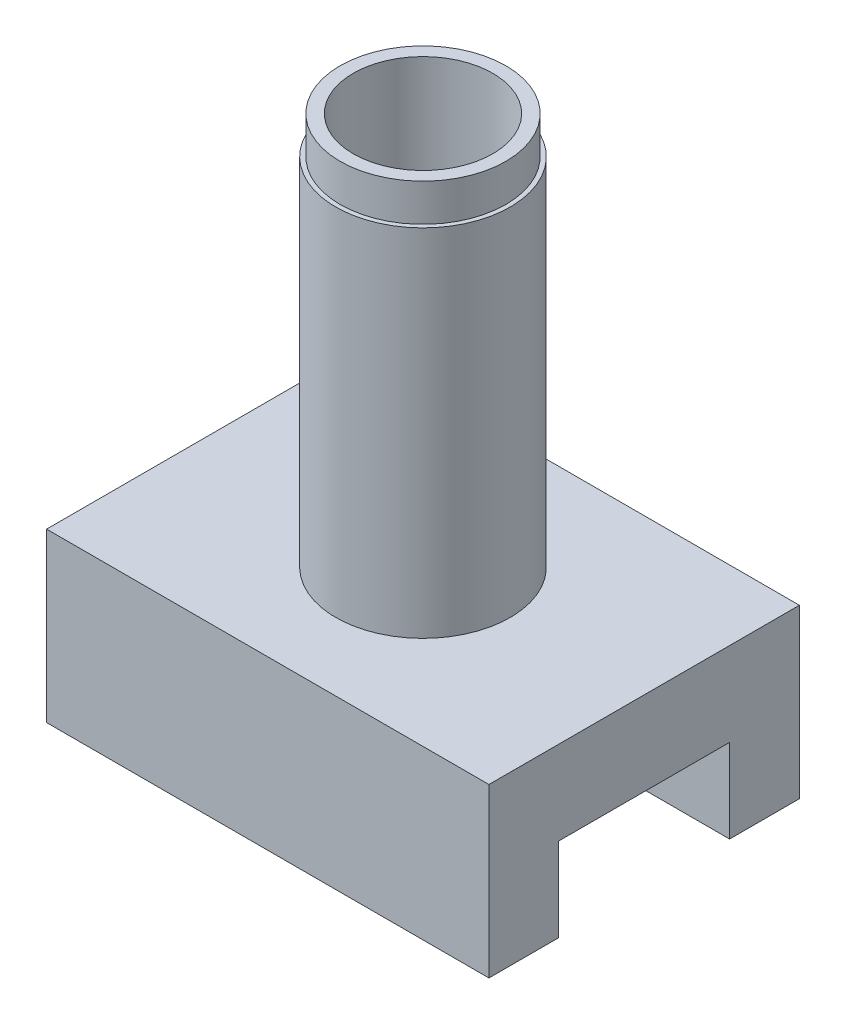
ISO-10303-21;
HEADER;
FILE_DESCRIPTION(('STEP AP214'),'2;1');
FILE_NAME('part.step','',(''),(''),'','','');
FILE_SCHEMA(('AUTOMOTIVE_DESIGN { 1 0 10303 214 1 1 1 1 }'));
ENDSEC;
DATA;
#1=APPLICATION_CONTEXT('core data for automotive mechanical design processes');
#2=APPLICATION_PROTOCOL_DEFINITION('international standard','automotive_design',2000,#1);
#3=PRODUCT_CONTEXT('',#1,'mechanical');
#4=PRODUCT('Part','Part','',(#3));
#5=PRODUCT_RELATED_PRODUCT_CATEGORY('part','',(#4));
#6=PRODUCT_DEFINITION_FORMATION('','',#4);
#7=PRODUCT_DEFINITION_CONTEXT('part definition',#1,'design');
#8=PRODUCT_DEFINITION('design','',#6,#7);
#9=PRODUCT_DEFINITION_SHAPE('','',#8);
#10=(LENGTH_UNIT() NAMED_UNIT(*) SI_UNIT(.MILLI.,.METRE.));
#11=(NAMED_UNIT(*) PLANE_ANGLE_UNIT() SI_UNIT($,.RADIAN.));
#12=(NAMED_UNIT(*) SI_UNIT($,.STERADIAN.) SOLID_ANGLE_UNIT());
#13=UNCERTAINTY_MEASURE_WITH_UNIT(LENGTH_MEASURE(1.E-05),#10,'distance_accuracy_value','');
#14=(GEOMETRIC_REPRESENTATION_CONTEXT(3) GLOBAL_UNCERTAINTY_ASSIGNED_CONTEXT((#13)) GLOBAL_UNIT_ASSIGNED_CONTEXT((#10,
#11,#12)) REPRESENTATION_CONTEXT('',''));
#15=CARTESIAN_POINT('',(0.,0.,0.));
#16=DIRECTION('',(0.,0.,1.));
#17=DIRECTION('',(1.,0.,0.));
#18=AXIS2_PLACEMENT_3D('',#15,#16,#17);
#19=CARTESIAN_POINT('',(0.,173.521,0.));
#20=DIRECTION('',(0.,-1.,0.));
#21=DIRECTION('',(0.,0.,-1.));
#22=AXIS2_PLACEMENT_3D('',#19,#20,#21);
#23=CYLINDRICAL_SURFACE('',#22,11.1125);
#24=CARTESIAN_POINT('',(0.,0.,0.));
#25=DIRECTION('',(0.,1.,0.));
#26=DIRECTION('',(0.,0.,1.));
#27=AXIS2_PLACEMENT_3D('',#24,#25,#26);
#28=CIRCLE('',#27,11.1125);
#29=CARTESIAN_POINT('',(0.,0.,11.1125));
#30=VERTEX_POINT('',#29);
#31=EDGE_CURVE('E210',#30,#30,#28,.T.);
#32=ORIENTED_EDGE('',*,*,#31,.F.);
#33=EDGE_LOOP('',(#32));
#34=FACE_BOUND('',#33,.T.);
#35=CARTESIAN_POINT('',(0.,16.804,0.));
#36=DIRECTION('',(0.,1.,0.));
#37=DIRECTION('',(0.,0.,1.));
#38=AXIS2_PLACEMENT_3D('',#35,#36,#37);
#39=CIRCLE('',#38,11.1125);
#40=CARTESIAN_POINT('',(0.,16.804,11.1125));
#41=VERTEX_POINT('',#40);
#42=EDGE_CURVE('E48',#41,#41,#39,.T.);
#43=ORIENTED_EDGE('',*,*,#42,.T.);
#44=EDGE_LOOP('',(#43));
#45=FACE_BOUND('',#44,.T.);
#46=ADVANCED_FACE('F44',(#34,#45),#23,.F.);
#47=CARTESIAN_POINT('',(80.5,-30.48,31.1));
#48=DIRECTION('',(0.,0.,1.));
#49=DIRECTION('',(0.,-1.,0.));
#50=AXIS2_PLACEMENT_3D('',#47,#48,#49);
#51=PLANE('',#50);
#52=DIRECTION('',(0.,1.,0.));
#53=VECTOR('',#52,1.);
#54=CARTESIAN_POINT('',(-80.5,-30.48,31.1));
#55=LINE('',#54,#53);
#56=CARTESIAN_POINT('',(-80.5,-30.48,31.1));
#57=VERTEX_POINT('',#56);
#58=CARTESIAN_POINT('',(-80.5,0.,31.1));
#59=VERTEX_POINT('',#58);
#60=EDGE_CURVE('E143',#57,#59,#55,.T.);
#61=ORIENTED_EDGE('',*,*,#60,.T.);
#62=DIRECTION('',(-1.,0.,0.));
#63=VECTOR('',#62,1.);
#64=CARTESIAN_POINT('',(80.5,0.,31.1));
#65=LINE('',#64,#63);
#66=CARTESIAN_POINT('',(80.5,0.,31.1));
#67=VERTEX_POINT('',#66);
#68=EDGE_CURVE('E54',#67,#59,#65,.T.);
#69=ORIENTED_EDGE('',*,*,#68,.F.);
#70=DIRECTION('',(0.,1.,0.));
#71=VECTOR('',#70,1.);
#72=CARTESIAN_POINT('',(80.5,-30.48,31.1));
#73=LINE('',#72,#71);
#74=CARTESIAN_POINT('',(80.5,-30.48,31.1));
#75=VERTEX_POINT('',#74);
#76=EDGE_CURVE('E158',#75,#67,#73,.T.);
#77=ORIENTED_EDGE('',*,*,#76,.F.);
#78=DIRECTION('',(-1.,0.,0.));
#79=VECTOR('',#78,1.);
#80=CARTESIAN_POINT('',(80.5,-30.48,31.1));
#81=LINE('',#80,#79);
#82=EDGE_CURVE('E139',#75,#57,#81,.T.);
#83=ORIENTED_EDGE('',*,*,#82,.T.);
#84=EDGE_LOOP('',(#61,#69,#77,#83));
#85=FACE_BOUND('',#84,.T.);
#86=ADVANCED_FACE('F46',(#85),#51,.F.);
#87=CARTESIAN_POINT('',(80.5,0.,31.1));
#88=DIRECTION('',(0.,1.,0.));
#89=DIRECTION('',(0.,0.,1.));
#90=AXIS2_PLACEMENT_3D('',#87,#88,#89);
#91=PLANE('',#90);
#92=ORIENTED_EDGE('',*,*,#31,.T.);
#93=EDGE_LOOP('',(#92));
#94=FACE_BOUND('',#93,.T.);
#95=DIRECTION('',(0.,0.,-1.));
#96=VECTOR('',#95,1.);
#97=CARTESIAN_POINT('',(-80.5,0.,31.1));
#98=LINE('',#97,#96);
#99=CARTESIAN_POINT('',(-80.5,0.,-31.1));
#100=VERTEX_POINT('',#99);
#101=EDGE_CURVE('E146',#59,#100,#98,.T.);
#102=ORIENTED_EDGE('',*,*,#101,.T.);
#103=DIRECTION('',(-1.,0.,0.));
#104=VECTOR('',#103,1.);
#105=CARTESIAN_POINT('',(80.5,0.,-31.1));
#106=LINE('',#105,#104);
#107=CARTESIAN_POINT('',(80.5,0.,-31.1));
#108=VERTEX_POINT('',#107);
#109=EDGE_CURVE('E168',#108,#100,#106,.T.);
#110=ORIENTED_EDGE('',*,*,#109,.F.);
#111=DIRECTION('',(0.,0.,-1.));
#112=VECTOR('',#111,1.);
#113=CARTESIAN_POINT('',(80.5,0.,31.1));
#114=LINE('',#113,#112);
#115=EDGE_CURVE('E106',#67,#108,#114,.T.);
#116=ORIENTED_EDGE('',*,*,#115,.F.);
#117=ORIENTED_EDGE('',*,*,#68,.T.);
#118=EDGE_LOOP('',(#102,#110,#116,#117));
#119=FACE_BOUND('',#118,.T.);
#120=ADVANCED_FACE('F172',(#94,#119),#91,.F.);
#121=CARTESIAN_POINT('',(80.5,0.,-31.1));
#122=DIRECTION('',(0.,0.,-1.));
#123=DIRECTION('',(0.,1.,0.));
#124=AXIS2_PLACEMENT_3D('',#121,#122,#123);
#125=PLANE('',#124);
#126=DIRECTION('',(0.,-1.,0.));
#127=VECTOR('',#126,1.);
#128=CARTESIAN_POINT('',(-80.5,0.,-31.1));
#129=LINE('',#128,#127);
#130=CARTESIAN_POINT('',(-80.5,-30.48,-31.1));
#131=VERTEX_POINT('',#130);
#132=EDGE_CURVE('E149',#100,#131,#129,.T.);
#133=ORIENTED_EDGE('',*,*,#132,.T.);
#134=DIRECTION('',(-1.,0.,0.));
#135=VECTOR('',#134,1.);
#136=CARTESIAN_POINT('',(80.5,-30.48,-31.1));
#137=LINE('',#136,#135);
#138=CARTESIAN_POINT('',(80.5,-30.48,-31.1));
#139=VERTEX_POINT('',#138);
#140=EDGE_CURVE('E165',#139,#131,#137,.T.);
#141=ORIENTED_EDGE('',*,*,#140,.F.);
#142=DIRECTION('',(0.,-1.,0.));
#143=VECTOR('',#142,1.);
#144=CARTESIAN_POINT('',(80.5,0.,-31.1));
#145=LINE('',#144,#143);
#146=EDGE_CURVE('E190',#108,#139,#145,.T.);
#147=ORIENTED_EDGE('',*,*,#146,.F.);
#148=ORIENTED_EDGE('',*,*,#109,.T.);
#149=EDGE_LOOP('',(#133,#141,#147,#148));
#150=FACE_BOUND('',#149,.T.);
#151=ADVANCED_FACE('F183',(#150),#125,.F.);
#152=CARTESIAN_POINT('',(80.5,-30.48,-31.1));
#153=DIRECTION('',(0.,1.,0.));
#154=DIRECTION('',(0.,0.,1.));
#155=AXIS2_PLACEMENT_3D('',#152,#153,#154);
#156=PLANE('',#155);
#157=DIRECTION('',(0.,0.,-1.));
#158=VECTOR('',#157,1.);
#159=CARTESIAN_POINT('',(-80.5,-30.48,-31.1));
#160=LINE('',#159,#158);
#161=CARTESIAN_POINT('',(-80.5,-30.48,-56.5));
#162=VERTEX_POINT('',#161);
#163=EDGE_CURVE('E151',#131,#162,#160,.T.);
#164=ORIENTED_EDGE('',*,*,#163,.T.);
#165=DIRECTION('',(-1.,0.,0.));
#166=VECTOR('',#165,1.);
#167=CARTESIAN_POINT('',(80.5,-30.48,-56.5));
#168=LINE('',#167,#166);
#169=CARTESIAN_POINT('',(80.5,-30.48,-56.5));
#170=VERTEX_POINT('',#169);
#171=EDGE_CURVE('E162',#170,#162,#168,.T.);
#172=ORIENTED_EDGE('',*,*,#171,.F.);
#173=DIRECTION('',(0.,0.,-1.));
#174=VECTOR('',#173,1.);
#175=CARTESIAN_POINT('',(80.5,-30.48,-31.1));
#176=LINE('',#175,#174);
#177=EDGE_CURVE('E189',#139,#170,#176,.T.);
#178=ORIENTED_EDGE('',*,*,#177,.F.);
#179=ORIENTED_EDGE('',*,*,#140,.T.);
#180=EDGE_LOOP('',(#164,#172,#178,#179));
#181=FACE_BOUND('',#180,.T.);
#182=ADVANCED_FACE('F187',(#181),#156,.F.);
#183=CARTESIAN_POINT('',(80.5,-30.48,-56.5));
#184=DIRECTION('',(0.,0.,1.));
#185=DIRECTION('',(0.,-1.,0.));
#186=AXIS2_PLACEMENT_3D('',#183,#184,#185);
#187=PLANE('',#186);
#188=DIRECTION('',(0.,1.,0.));
#189=VECTOR('',#188,1.);
#190=CARTESIAN_POINT('',(-80.5,-30.48,-56.5));
#191=LINE('',#190,#189);
#192=CARTESIAN_POINT('',(-80.5,30.52,-56.5));
#193=VERTEX_POINT('',#192);
#194=EDGE_CURVE('E153',#162,#193,#191,.T.);
#195=ORIENTED_EDGE('',*,*,#194,.T.);
#196=DIRECTION('',(-1.,0.,0.));
#197=VECTOR('',#196,1.);
#198=CARTESIAN_POINT('',(80.5,30.52,-56.5));
#199=LINE('',#198,#197);
#200=CARTESIAN_POINT('',(80.5,30.52,-56.5));
#201=VERTEX_POINT('',#200);
#202=EDGE_CURVE('E134',#201,#193,#199,.T.);
#203=ORIENTED_EDGE('',*,*,#202,.F.);
#204=DIRECTION('',(0.,1.,0.));
#205=VECTOR('',#204,1.);
#206=CARTESIAN_POINT('',(80.5,-30.48,-56.5));
#207=LINE('',#206,#205);
#208=EDGE_CURVE('E125',#170,#201,#207,.T.);
#209=ORIENTED_EDGE('',*,*,#208,.F.);
#210=ORIENTED_EDGE('',*,*,#171,.T.);
#211=EDGE_LOOP('',(#195,#203,#209,#210));
#212=FACE_BOUND('',#211,.T.);
#213=ADVANCED_FACE('F273',(#212),#187,.F.);
#214=CARTESIAN_POINT('',(80.5,30.52,-56.5));
#215=DIRECTION('',(0.,-1.,0.));
#216=DIRECTION('',(0.,0.,-1.));
#217=AXIS2_PLACEMENT_3D('',#214,#215,#216);
#218=PLANE('',#217);
#219=CARTESIAN_POINT('',(0.,30.52,0.));
#220=DIRECTION('',(0.,-1.,0.));
#221=DIRECTION('',(0.,0.,-1.));
#222=AXIS2_PLACEMENT_3D('',#219,#220,#221);
#223=CIRCLE('',#222,31.75);
#224=CARTESIAN_POINT('',(0.,30.52,-31.75));
#225=VERTEX_POINT('',#224);
#226=EDGE_CURVE('E13',#225,#225,#223,.F.);
#227=ORIENTED_EDGE('',*,*,#226,.F.);
#228=EDGE_LOOP('',(#227));
#229=FACE_BOUND('',#228,.T.);
#230=DIRECTION('',(0.,0.,1.));
#231=VECTOR('',#230,1.);
#232=CARTESIAN_POINT('',(-80.5,30.52,-56.5));
#233=LINE('',#232,#231);
#234=CARTESIAN_POINT('',(-80.5,30.52,56.5));
#235=VERTEX_POINT('',#234);
#236=EDGE_CURVE('E133',#193,#235,#233,.T.);
#237=ORIENTED_EDGE('',*,*,#236,.T.);
#238=DIRECTION('',(-1.,0.,0.));
#239=VECTOR('',#238,1.);
#240=CARTESIAN_POINT('',(80.5,30.52,56.5));
#241=LINE('',#240,#239);
#242=CARTESIAN_POINT('',(80.5,30.52,56.5));
#243=VERTEX_POINT('',#242);
#244=EDGE_CURVE('E130',#243,#235,#241,.T.);
#245=ORIENTED_EDGE('',*,*,#244,.F.);
#246=DIRECTION('',(0.,0.,1.));
#247=VECTOR('',#246,1.);
#248=CARTESIAN_POINT('',(80.5,30.52,-56.5));
#249=LINE('',#248,#247);
#250=EDGE_CURVE('E119',#201,#243,#249,.T.);
#251=ORIENTED_EDGE('',*,*,#250,.F.);
#252=ORIENTED_EDGE('',*,*,#202,.T.);
#253=EDGE_LOOP('',(#237,#245,#251,#252));
#254=FACE_BOUND('',#253,.T.);
#255=ADVANCED_FACE('F131',(#229,#254),#218,.F.);
#256=CARTESIAN_POINT('',(80.5,30.52,56.5));
#257=DIRECTION('',(0.,0.,-1.));
#258=DIRECTION('',(0.,1.,0.));
#259=AXIS2_PLACEMENT_3D('',#256,#257,#258);
#260=PLANE('',#259);
#261=DIRECTION('',(0.,-1.,0.));
#262=VECTOR('',#261,1.);
#263=CARTESIAN_POINT('',(-80.5,30.52,56.5));
#264=LINE('',#263,#262);
#265=CARTESIAN_POINT('',(-80.5,-30.48,56.5));
#266=VERTEX_POINT('',#265);
#267=EDGE_CURVE('E91',#235,#266,#264,.T.);
#268=ORIENTED_EDGE('',*,*,#267,.T.);
#269=DIRECTION('',(-1.,0.,0.));
#270=VECTOR('',#269,1.);
#271=CARTESIAN_POINT('',(80.5,-30.48,56.5));
#272=LINE('',#271,#270);
#273=CARTESIAN_POINT('',(80.5,-30.48,56.5));
#274=VERTEX_POINT('',#273);
#275=EDGE_CURVE('E135',#274,#266,#272,.T.);
#276=ORIENTED_EDGE('',*,*,#275,.F.);
#277=DIRECTION('',(0.,-1.,0.));
#278=VECTOR('',#277,1.);
#279=CARTESIAN_POINT('',(80.5,30.52,56.5));
#280=LINE('',#279,#278);
#281=EDGE_CURVE('E123',#243,#274,#280,.T.);
#282=ORIENTED_EDGE('',*,*,#281,.F.);
#283=ORIENTED_EDGE('',*,*,#244,.T.);
#284=EDGE_LOOP('',(#268,#276,#282,#283));
#285=FACE_BOUND('',#284,.T.);
#286=ADVANCED_FACE('F137',(#285),#260,.F.);
#287=CARTESIAN_POINT('',(80.5,-30.48,56.5));
#288=DIRECTION('',(0.,1.,0.));
#289=DIRECTION('',(0.,0.,1.));
#290=AXIS2_PLACEMENT_3D('',#287,#288,#289);
#291=PLANE('',#290);
#292=DIRECTION('',(0.,0.,-1.));
#293=VECTOR('',#292,1.);
#294=CARTESIAN_POINT('',(-80.5,-30.48,56.5));
#295=LINE('',#294,#293);
#296=EDGE_CURVE('E97',#266,#57,#295,.T.);
#297=ORIENTED_EDGE('',*,*,#296,.T.);
#298=ORIENTED_EDGE('',*,*,#82,.F.);
#299=DIRECTION('',(0.,0.,-1.));
#300=VECTOR('',#299,1.);
#301=CARTESIAN_POINT('',(80.5,-30.48,56.5));
#302=LINE('',#301,#300);
#303=EDGE_CURVE('E62',#274,#75,#302,.T.);
#304=ORIENTED_EDGE('',*,*,#303,.F.);
#305=ORIENTED_EDGE('',*,*,#275,.T.);
#306=EDGE_LOOP('',(#297,#298,#304,#305));
#307=FACE_BOUND('',#306,.T.);
#308=ADVANCED_FACE('F264',(#307),#291,.F.);
#309=CARTESIAN_POINT('',(80.5,0.,0.));
#310=DIRECTION('',(-1.,0.,0.));
#311=DIRECTION('',(0.,0.,1.));
#312=AXIS2_PLACEMENT_3D('',#309,#310,#311);
#313=PLANE('',#312);
#314=ORIENTED_EDGE('',*,*,#76,.T.);
#315=ORIENTED_EDGE('',*,*,#115,.T.);
#316=ORIENTED_EDGE('',*,*,#146,.T.);
#317=ORIENTED_EDGE('',*,*,#177,.T.);
#318=ORIENTED_EDGE('',*,*,#208,.T.);
#319=ORIENTED_EDGE('',*,*,#250,.T.);
#320=ORIENTED_EDGE('',*,*,#281,.T.);
#321=ORIENTED_EDGE('',*,*,#303,.T.);
#322=EDGE_LOOP('',(#314,#315,#316,#317,#318,#319,#320,#321));
#323=FACE_BOUND('',#322,.T.);
#324=ADVANCED_FACE('F121',(#323),#313,.F.);
#325=CARTESIAN_POINT('',(-80.5,0.,0.));
#326=DIRECTION('',(-1.,0.,0.));
#327=DIRECTION('',(0.,0.,1.));
#328=AXIS2_PLACEMENT_3D('',#325,#326,#327);
#329=PLANE('',#328);
#330=ORIENTED_EDGE('',*,*,#60,.F.);
#331=ORIENTED_EDGE('',*,*,#296,.F.);
#332=ORIENTED_EDGE('',*,*,#267,.F.);
#333=ORIENTED_EDGE('',*,*,#236,.F.);
#334=ORIENTED_EDGE('',*,*,#194,.F.);
#335=ORIENTED_EDGE('',*,*,#163,.F.);
#336=ORIENTED_EDGE('',*,*,#132,.F.);
#337=ORIENTED_EDGE('',*,*,#101,.F.);
#338=EDGE_LOOP('',(#330,#331,#332,#333,#334,#335,#336,#337));
#339=FACE_BOUND('',#338,.T.);
#340=ADVANCED_FACE('F177',(#339),#329,.T.);
#341=CARTESIAN_POINT('',(0.,173.52,0.));
#342=DIRECTION('',(0.,-1.,0.));
#343=DIRECTION('',(0.,0.,-1.));
#344=AXIS2_PLACEMENT_3D('',#341,#342,#343);
#345=CYLINDRICAL_SURFACE('',#344,31.75);
#346=CARTESIAN_POINT('',(0.,159.92,0.));
#347=DIRECTION('',(0.,-1.,0.));
#348=DIRECTION('',(0.,0.,-1.));
#349=AXIS2_PLACEMENT_3D('',#346,#347,#348);
#350=CIRCLE('',#349,31.75);
#351=CARTESIAN_POINT('',(0.,159.92,-31.75));
#352=VERTEX_POINT('',#351);
#353=EDGE_CURVE('E199',#352,#352,#350,.T.);
#354=ORIENTED_EDGE('',*,*,#353,.T.);
#355=EDGE_LOOP('',(#354));
#356=FACE_BOUND('',#355,.T.);
#357=ORIENTED_EDGE('',*,*,#226,.T.);
#358=EDGE_LOOP('',(#357));
#359=FACE_BOUND('',#358,.T.);
#360=ADVANCED_FACE('F250',(#356,#359),#345,.T.);
#361=CARTESIAN_POINT('',(31.75,159.92,0.));
#362=DIRECTION('',(0.,-1.,0.));
#363=DIRECTION('',(0.,0.,-1.));
#364=AXIS2_PLACEMENT_3D('',#361,#362,#363);
#365=PLANE('',#364);
#366=ORIENTED_EDGE('',*,*,#353,.F.);
#367=EDGE_LOOP('',(#366));
#368=FACE_BOUND('',#367,.T.);
#369=CARTESIAN_POINT('',(0.,159.92,0.));
#370=DIRECTION('',(0.,-1.,0.));
#371=DIRECTION('',(0.,0.,-1.));
#372=AXIS2_PLACEMENT_3D('',#369,#370,#371);
#373=CIRCLE('',#372,30.1625);
#374=CARTESIAN_POINT('',(0.,159.92,-30.1625));
#375=VERTEX_POINT('',#374);
#376=EDGE_CURVE('E204',#375,#375,#373,.T.);
#377=ORIENTED_EDGE('',*,*,#376,.T.);
#378=EDGE_LOOP('',(#377));
#379=FACE_BOUND('',#378,.T.);
#380=ADVANCED_FACE('F246',(#368,#379),#365,.F.);
#381=CARTESIAN_POINT('',(0.,0.,0.));
#382=DIRECTION('',(0.,-1.,0.));
#383=DIRECTION('',(0.,0.,-1.));
#384=AXIS2_PLACEMENT_3D('',#381,#382,#383);
#385=CYLINDRICAL_SURFACE('',#384,30.1625);
#386=ORIENTED_EDGE('',*,*,#376,.F.);
#387=EDGE_LOOP('',(#386));
#388=FACE_BOUND('',#387,.T.);
#389=CARTESIAN_POINT('',(0.,173.52,0.));
#390=DIRECTION('',(0.,-1.,0.));
#391=DIRECTION('',(0.,0.,-1.));
#392=AXIS2_PLACEMENT_3D('',#389,#390,#391);
#393=CIRCLE('',#392,30.1625);
#394=CARTESIAN_POINT('',(0.,173.52,-30.1625));
#395=VERTEX_POINT('',#394);
#396=EDGE_CURVE('E207',#395,#395,#393,.T.);
#397=ORIENTED_EDGE('',*,*,#396,.T.);
#398=EDGE_LOOP('',(#397));
#399=FACE_BOUND('',#398,.T.);
#400=ADVANCED_FACE('F242',(#388,#399),#385,.T.);
#401=CARTESIAN_POINT('',(0.,30.52,0.));
#402=DIRECTION('',(0.,1.,0.));
#403=DIRECTION('',(0.,0.,1.));
#404=AXIS2_PLACEMENT_3D('',#401,#402,#403);
#405=CIRCLE('',#404,19.05);
#406=CARTESIAN_POINT('',(0.,30.52,19.05));
#407=VERTEX_POINT('',#406);
#408=EDGE_CURVE('E213',#407,#407,#405,.T.);
#409=ORIENTED_EDGE('',*,*,#408,.F.);
#410=EDGE_LOOP('',(#409));
#411=FACE_BOUND('',#410,.T.);
#412=CARTESIAN_POINT('',(0.,30.52,0.));
#413=DIRECTION('',(0.,1.,0.));
#414=DIRECTION('',(0.,0.,1.));
#415=AXIS2_PLACEMENT_3D('',#412,#413,#414);
#416=CIRCLE('',#415,25.4);
#417=CARTESIAN_POINT('',(0.,30.52,25.4));
#418=VERTEX_POINT('',#417);
#419=EDGE_CURVE('E196',#418,#418,#416,.T.);
#420=ORIENTED_EDGE('',*,*,#419,.T.);
#421=EDGE_LOOP('',(#420));
#422=FACE_BOUND('',#421,.T.);
#423=ADVANCED_FACE('F245',(#411,#422),#218,.F.);
#424=CARTESIAN_POINT('',(0.,173.52,0.));
#425=DIRECTION('',(0.,-1.,0.));
#426=DIRECTION('',(0.,0.,-1.));
#427=AXIS2_PLACEMENT_3D('',#424,#425,#426);
#428=CYLINDRICAL_SURFACE('',#427,25.4);
#429=CARTESIAN_POINT('',(0.,173.52,0.));
#430=DIRECTION('',(0.,1.,0.));
#431=DIRECTION('',(0.,0.,1.));
#432=AXIS2_PLACEMENT_3D('',#429,#430,#431);
#433=CIRCLE('',#432,25.4);
#434=CARTESIAN_POINT('',(0.,173.52,25.4));
#435=VERTEX_POINT('',#434);
#436=EDGE_CURVE('E147',#435,#435,#433,.T.);
#437=ORIENTED_EDGE('',*,*,#436,.T.);
#438=EDGE_LOOP('',(#437));
#439=FACE_BOUND('',#438,.T.);
#440=ORIENTED_EDGE('',*,*,#419,.F.);
#441=EDGE_LOOP('',(#440));
#442=FACE_BOUND('',#441,.T.);
#443=ADVANCED_FACE('F252',(#439,#442),#428,.F.);
#444=CARTESIAN_POINT('',(0.,173.52,0.));
#445=DIRECTION('',(0.,1.,0.));
#446=DIRECTION('',(0.,0.,1.));
#447=AXIS2_PLACEMENT_3D('',#444,#445,#446);
#448=PLANE('',#447);
#449=ORIENTED_EDGE('',*,*,#436,.F.);
#450=EDGE_LOOP('',(#449));
#451=FACE_BOUND('',#450,.T.);
#452=ORIENTED_EDGE('',*,*,#396,.F.);
#453=EDGE_LOOP('',(#452));
#454=FACE_BOUND('',#453,.T.);
#455=ADVANCED_FACE('F231',(#451,#454),#448,.T.);
#456=CARTESIAN_POINT('',(0.,16.804,0.));
#457=DIRECTION('',(0.,1.,0.));
#458=DIRECTION('',(0.,0.,1.));
#459=AXIS2_PLACEMENT_3D('',#456,#457,#458);
#460=CYLINDRICAL_SURFACE('',#459,19.05);
#461=CARTESIAN_POINT('',(0.,16.804,0.));
#462=DIRECTION('',(0.,1.,0.));
#463=DIRECTION('',(0.,0.,1.));
#464=AXIS2_PLACEMENT_3D('',#461,#462,#463);
#465=CIRCLE('',#464,19.05);
#466=CARTESIAN_POINT('',(0.,16.804,19.05));
#467=VERTEX_POINT('',#466);
#468=EDGE_CURVE('E216',#467,#467,#465,.T.);
#469=ORIENTED_EDGE('',*,*,#468,.F.);
#470=EDGE_LOOP('',(#469));
#471=FACE_BOUND('',#470,.T.);
#472=ORIENTED_EDGE('',*,*,#408,.T.);
#473=EDGE_LOOP('',(#472));
#474=FACE_BOUND('',#473,.T.);
#475=ADVANCED_FACE('F226',(#471,#474),#460,.F.);
#476=CARTESIAN_POINT('',(0.,16.804,0.));
#477=DIRECTION('',(0.,1.,0.));
#478=DIRECTION('',(0.,0.,1.));
#479=AXIS2_PLACEMENT_3D('',#476,#477,#478);
#480=PLANE('',#479);
#481=ORIENTED_EDGE('',*,*,#42,.F.);
#482=EDGE_LOOP('',(#481));
#483=FACE_BOUND('',#482,.T.);
#484=ORIENTED_EDGE('',*,*,#468,.T.);
#485=EDGE_LOOP('',(#484));
#486=FACE_BOUND('',#485,.T.);
#487=ADVANCED_FACE('F224',(#483,#486),#480,.T.);
#488=CLOSED_SHELL('',(#46,#86,#120,#151,#182,#213,#255,#286,#308,#324,#340,#360,#380,#400,#423,
#443,#455,#475,#487));
#489=MANIFOLD_SOLID_BREP('B2',#488);
#490=ADVANCED_BREP_SHAPE_REPRESENTATION('',(#18,#489),#14);
#491=SHAPE_DEFINITION_REPRESENTATION(#9,#490);
ENDSEC;
END-ISO-10303-21;
